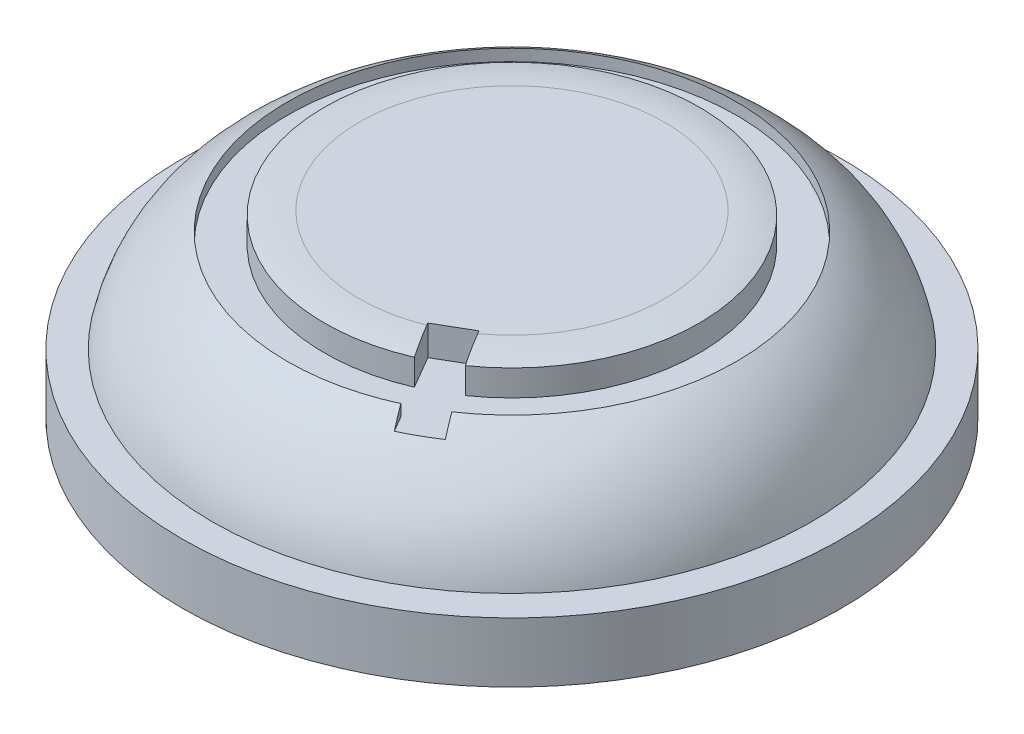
ISO-10303-21;
HEADER;
FILE_DESCRIPTION(('STEP AP214'),'2;1');
FILE_NAME('part.step','',(''),(''),'','','');
FILE_SCHEMA(('AUTOMOTIVE_DESIGN { 1 0 10303 214 1 1 1 1 }'));
ENDSEC;
DATA;
#1=APPLICATION_CONTEXT('core data for automotive mechanical design processes');
#2=APPLICATION_PROTOCOL_DEFINITION('international standard','automotive_design',2000,#1);
#3=PRODUCT_CONTEXT('',#1,'mechanical');
#4=PRODUCT('Part','Part','',(#3));
#5=PRODUCT_RELATED_PRODUCT_CATEGORY('part','',(#4));
#6=PRODUCT_DEFINITION_FORMATION('','',#4);
#7=PRODUCT_DEFINITION_CONTEXT('part definition',#1,'design');
#8=PRODUCT_DEFINITION('design','',#6,#7);
#9=PRODUCT_DEFINITION_SHAPE('','',#8);
#10=(LENGTH_UNIT() NAMED_UNIT(*) SI_UNIT(.MILLI.,.METRE.));
#11=(NAMED_UNIT(*) PLANE_ANGLE_UNIT() SI_UNIT($,.RADIAN.));
#12=(NAMED_UNIT(*) SI_UNIT($,.STERADIAN.) SOLID_ANGLE_UNIT());
#13=UNCERTAINTY_MEASURE_WITH_UNIT(LENGTH_MEASURE(1.E-05),#10,'distance_accuracy_value','');
#14=(GEOMETRIC_REPRESENTATION_CONTEXT(3) GLOBAL_UNCERTAINTY_ASSIGNED_CONTEXT((#13)) GLOBAL_UNIT_ASSIGNED_CONTEXT((#10,
#11,#12)) REPRESENTATION_CONTEXT('',''));
#15=CARTESIAN_POINT('',(0.,0.,0.));
#16=DIRECTION('',(0.,0.,1.));
#17=DIRECTION('',(1.,0.,0.));
#18=AXIS2_PLACEMENT_3D('',#15,#16,#17);
#19=CARTESIAN_POINT('',(0.,-5.,0.));
#20=DIRECTION('',(0.,1.,0.));
#21=DIRECTION('',(0.,0.,1.));
#22=AXIS2_PLACEMENT_3D('',#19,#20,#21);
#23=TOROIDAL_SURFACE('',#22,5.10102051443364,5.);
#24=CARTESIAN_POINT('',(0.,-0.613099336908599,0.));
#25=DIRECTION('',(0.,-1.,0.));
#26=DIRECTION('',(0.,0.,-1.));
#27=AXIS2_PLACEMENT_3D('',#24,#25,#26);
#28=CIRCLE('',#27,7.5);
#29=CARTESIAN_POINT('',(4.20402445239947,-0.613099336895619,6.21097242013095));
#30=VERTEX_POINT('',#29);
#31=CARTESIAN_POINT('',(3.1139140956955,-0.613099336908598,6.82301538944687));
#32=VERTEX_POINT('',#31);
#33=EDGE_CURVE('E11',#30,#32,#28,.F.);
#34=ORIENTED_EDGE('',*,*,#33,.F.);
#35=CARTESIAN_POINT('',(4.5077473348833,-1.0002,6.7313496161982));
#36=CARTESIAN_POINT('',(4.45943803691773,-0.928465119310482,6.64857989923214));
#37=CARTESIAN_POINT('',(4.40996341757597,-0.860328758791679,6.56381360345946));
#38=CARTESIAN_POINT('',(4.30868354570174,-0.731253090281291,6.39028787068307));
#39=CARTESIAN_POINT('',(4.25687829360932,-0.670313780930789,6.30152843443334));
#40=CARTESIAN_POINT('',(4.20390772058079,-0.612972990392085,6.21077242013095));
#41=B_SPLINE_CURVE_WITH_KNOTS('',3,(#35,#36,#37,#38,#39,#40),.UNSPECIFIED.,.F.,.F.,(4,2,4),(0.,
0.358441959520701,0.716883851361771),.UNSPECIFIED.);
#42=CARTESIAN_POINT('',(4.5076126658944,-1.,6.73111888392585));
#43=VERTEX_POINT('',#42);
#44=EDGE_CURVE('E48',#43,#30,#41,.T.);
#45=ORIENTED_EDGE('',*,*,#44,.F.);
#46=CARTESIAN_POINT('',(0.,-1.,0.));
#47=DIRECTION('',(0.,1.,0.));
#48=DIRECTION('',(0.,0.,1.));
#49=AXIS2_PLACEMENT_3D('',#46,#47,#48);
#50=CIRCLE('',#49,8.10102051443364);
#51=CARTESIAN_POINT('',(3.41828933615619,-1.,7.34451028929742));
#52=VERTEX_POINT('',#51);
#53=EDGE_CURVE('E240',#43,#52,#50,.F.);
#54=ORIENTED_EDGE('',*,*,#53,.T.);
#55=CARTESIAN_POINT('',(3.11379736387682,-0.612973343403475,6.82281538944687));
#56=CARTESIAN_POINT('',(3.16689960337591,-0.670294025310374,6.91379699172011));
#57=CARTESIAN_POINT('',(3.21883629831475,-0.731223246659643,7.00278163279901));
#58=CARTESIAN_POINT('',(3.32037862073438,-0.86029879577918,7.17675702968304));
#59=CARTESIAN_POINT('',(3.36998424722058,-0.928445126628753,7.26174778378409));
#60=CARTESIAN_POINT('',(3.41842432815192,-1.0002,7.34474157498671));
#61=B_SPLINE_CURVE_WITH_KNOTS('',3,(#55,#56,#57,#58,#59,#60),.UNSPECIFIED.,.F.,.F.,(4,2,4),(0.,
0.359099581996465,0.718199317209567),.UNSPECIFIED.);
#62=EDGE_CURVE('E233',#32,#52,#61,.T.);
#63=ORIENTED_EDGE('',*,*,#62,.F.);
#64=EDGE_LOOP('',(#34,#45,#54,#63));
#65=FACE_BOUND('',#64,.T.);
#66=CARTESIAN_POINT('',(0.,-4.,0.));
#67=DIRECTION('',(0.,1.,0.));
#68=DIRECTION('',(0.,0.,1.));
#69=AXIS2_PLACEMENT_3D('',#66,#67,#68);
#70=CIRCLE('',#69,10.);
#71=CARTESIAN_POINT('',(0.,-4.,10.));
#72=VERTEX_POINT('',#71);
#73=EDGE_CURVE('E185',#72,#72,#70,.T.);
#74=ORIENTED_EDGE('',*,*,#73,.T.);
#75=EDGE_LOOP('',(#74));
#76=FACE_BOUND('',#75,.T.);
#77=ADVANCED_FACE('F39',(#65,#76),#23,.T.);
#78=CARTESIAN_POINT('',(-10.,-4.,0.));
#79=DIRECTION('',(0.,1.,0.));
#80=DIRECTION('',(0.,0.,1.));
#81=AXIS2_PLACEMENT_3D('',#78,#79,#80);
#82=PLANE('',#81);
#83=CARTESIAN_POINT('',(0.,-4.,0.));
#84=DIRECTION('',(0.,1.,0.));
#85=DIRECTION('',(0.,0.,1.));
#86=AXIS2_PLACEMENT_3D('',#83,#84,#85);
#87=CIRCLE('',#86,11.);
#88=CARTESIAN_POINT('',(0.,-4.,11.));
#89=VERTEX_POINT('',#88);
#90=EDGE_CURVE('E181',#89,#89,#87,.T.);
#91=ORIENTED_EDGE('',*,*,#90,.T.);
#92=EDGE_LOOP('',(#91));
#93=FACE_BOUND('',#92,.T.);
#94=ORIENTED_EDGE('',*,*,#73,.F.);
#95=EDGE_LOOP('',(#94));
#96=FACE_BOUND('',#95,.T.);
#97=ADVANCED_FACE('F258',(#93,#96),#82,.T.);
#98=CARTESIAN_POINT('',(0.,8.27404181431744,0.));
#99=DIRECTION('',(0.,1.,0.));
#100=DIRECTION('',(0.,0.,1.));
#101=AXIS2_PLACEMENT_3D('',#98,#99,#100);
#102=CYLINDRICAL_SURFACE('',#101,11.);
#103=CARTESIAN_POINT('',(0.,-6.,0.));
#104=DIRECTION('',(0.,1.,0.));
#105=DIRECTION('',(0.,0.,1.));
#106=AXIS2_PLACEMENT_3D('',#103,#104,#105);
#107=CIRCLE('',#106,11.);
#108=CARTESIAN_POINT('',(0.,-6.,11.));
#109=VERTEX_POINT('',#108);
#110=EDGE_CURVE('E177',#109,#109,#107,.T.);
#111=ORIENTED_EDGE('',*,*,#110,.T.);
#112=EDGE_LOOP('',(#111));
#113=FACE_BOUND('',#112,.T.);
#114=ORIENTED_EDGE('',*,*,#90,.F.);
#115=EDGE_LOOP('',(#114));
#116=FACE_BOUND('',#115,.T.);
#117=ADVANCED_FACE('F263',(#113,#116),#102,.T.);
#118=CARTESIAN_POINT('',(-11.,-6.,0.));
#119=DIRECTION('',(0.,-1.,0.));
#120=DIRECTION('',(0.,0.,-1.));
#121=AXIS2_PLACEMENT_3D('',#118,#119,#120);
#122=PLANE('',#121);
#123=CARTESIAN_POINT('',(0.,-6.,0.));
#124=DIRECTION('',(0.,1.,0.));
#125=DIRECTION('',(0.,0.,1.));
#126=AXIS2_PLACEMENT_3D('',#123,#124,#125);
#127=CIRCLE('',#126,10.);
#128=CARTESIAN_POINT('',(0.,-6.,10.));
#129=VERTEX_POINT('',#128);
#130=EDGE_CURVE('E173',#129,#129,#127,.T.);
#131=ORIENTED_EDGE('',*,*,#130,.T.);
#132=EDGE_LOOP('',(#131));
#133=FACE_BOUND('',#132,.T.);
#134=ORIENTED_EDGE('',*,*,#110,.F.);
#135=EDGE_LOOP('',(#134));
#136=FACE_BOUND('',#135,.T.);
#137=ADVANCED_FACE('F357',(#133,#136),#122,.T.);
#138=CARTESIAN_POINT('',(0.,8.27404181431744,0.));
#139=DIRECTION('',(0.,1.,0.));
#140=DIRECTION('',(0.,0.,1.));
#141=AXIS2_PLACEMENT_3D('',#138,#139,#140);
#142=CYLINDRICAL_SURFACE('',#141,10.);
#143=CARTESIAN_POINT('',(0.,-4.5,0.));
#144=DIRECTION('',(0.,1.,0.));
#145=DIRECTION('',(0.,0.,1.));
#146=AXIS2_PLACEMENT_3D('',#143,#144,#145);
#147=CIRCLE('',#146,10.);
#148=CARTESIAN_POINT('',(0.,-4.5,10.));
#149=VERTEX_POINT('',#148);
#150=EDGE_CURVE('E166',#149,#149,#147,.T.);
#151=ORIENTED_EDGE('',*,*,#150,.T.);
#152=EDGE_LOOP('',(#151));
#153=FACE_BOUND('',#152,.T.);
#154=ORIENTED_EDGE('',*,*,#130,.F.);
#155=EDGE_LOOP('',(#154));
#156=FACE_BOUND('',#155,.T.);
#157=ADVANCED_FACE('F347',(#153,#156),#142,.F.);
#158=CARTESIAN_POINT('',(-10.,-4.5,0.));
#159=DIRECTION('',(0.,-1.,0.));
#160=DIRECTION('',(0.,0.,-1.));
#161=AXIS2_PLACEMENT_3D('',#158,#159,#160);
#162=PLANE('',#161);
#163=ORIENTED_EDGE('',*,*,#150,.F.);
#164=EDGE_LOOP('',(#163));
#165=FACE_BOUND('',#164,.T.);
#166=ADVANCED_FACE('F333',(#165),#162,.T.);
#167=CARTESIAN_POINT('',(0.,-1.,0.));
#168=DIRECTION('',(0.,1.,0.));
#169=DIRECTION('',(0.,0.,1.));
#170=AXIS2_PLACEMENT_3D('',#167,#168,#169);
#171=CYLINDRICAL_SURFACE('',#170,7.5);
#172=ORIENTED_EDGE('',*,*,#33,.T.);
#173=DIRECTION('',(0.,1.,0.));
#174=VECTOR('',#173,1.);
#175=CARTESIAN_POINT('',(3.1139140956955,-1.,6.82301538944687));
#176=LINE('',#175,#174);
#177=CARTESIAN_POINT('',(3.1139140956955,-1.,6.82301538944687));
#178=VERTEX_POINT('',#177);
#179=EDGE_CURVE('E161',#178,#32,#176,.T.);
#180=ORIENTED_EDGE('',*,*,#179,.F.);
#181=CARTESIAN_POINT('',(0.,-1.,0.));
#182=DIRECTION('',(0.,1.,0.));
#183=DIRECTION('',(0.,0.,1.));
#184=AXIS2_PLACEMENT_3D('',#181,#182,#183);
#185=CIRCLE('',#184,7.5);
#186=CARTESIAN_POINT('',(4.20402445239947,-1.,6.21097242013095));
#187=VERTEX_POINT('',#186);
#188=EDGE_CURVE('E147',#187,#178,#185,.T.);
#189=ORIENTED_EDGE('',*,*,#188,.F.);
#190=DIRECTION('',(0.,1.,0.));
#191=VECTOR('',#190,1.);
#192=CARTESIAN_POINT('',(4.20402445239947,-1.,6.21097242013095));
#193=LINE('',#192,#191);
#194=EDGE_CURVE('E162',#187,#30,#193,.T.);
#195=ORIENTED_EDGE('',*,*,#194,.T.);
#196=EDGE_LOOP('',(#172,#180,#189,#195));
#197=FACE_BOUND('',#196,.T.);
#198=ADVANCED_FACE('F223',(#197),#171,.F.);
#199=CARTESIAN_POINT('',(4.78695355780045,-1.,7.20972171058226));
#200=DIRECTION('',(0.863656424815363,0.,-0.504080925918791));
#201=DIRECTION('',(-0.504080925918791,0.,-0.863656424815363));
#202=AXIS2_PLACEMENT_3D('',#199,#200,#201);
#203=PLANE('',#202);
#204=ORIENTED_EDGE('',*,*,#44,.T.);
#205=ORIENTED_EDGE('',*,*,#194,.F.);
#206=DIRECTION('',(-0.504080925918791,0.,-0.863656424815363));
#207=VECTOR('',#206,1.);
#208=CARTESIAN_POINT('',(4.78695355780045,-1.,7.20972171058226));
#209=LINE('',#208,#207);
#210=EDGE_CURVE('E158',#43,#187,#209,.T.);
#211=ORIENTED_EDGE('',*,*,#210,.F.);
#212=EDGE_LOOP('',(#204,#205,#211));
#213=FACE_BOUND('',#212,.T.);
#214=ADVANCED_FACE('F219',(#213),#203,.F.);
#215=CARTESIAN_POINT('',(3.1139140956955,-1.,6.82301538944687));
#216=DIRECTION('',(-0.863656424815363,0.,0.50408092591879));
#217=DIRECTION('',(0.50408092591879,0.,0.863656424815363));
#218=AXIS2_PLACEMENT_3D('',#215,#216,#217);
#219=PLANE('',#218);
#220=ORIENTED_EDGE('',*,*,#62,.T.);
#221=DIRECTION('',(0.50408092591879,0.,0.863656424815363));
#222=VECTOR('',#221,1.);
#223=CARTESIAN_POINT('',(3.1139140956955,-1.,6.82301538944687));
#224=LINE('',#223,#222);
#225=EDGE_CURVE('E55',#178,#52,#224,.T.);
#226=ORIENTED_EDGE('',*,*,#225,.F.);
#227=ORIENTED_EDGE('',*,*,#179,.T.);
#228=EDGE_LOOP('',(#220,#226,#227));
#229=FACE_BOUND('',#228,.T.);
#230=ADVANCED_FACE('F218',(#229),#219,.F.);
#231=CARTESIAN_POINT('',(0.,-1.,0.));
#232=DIRECTION('',(0.,1.,0.));
#233=DIRECTION('',(0.,0.,1.));
#234=AXIS2_PLACEMENT_3D('',#231,#232,#233);
#235=PLANE('',#234);
#236=DIRECTION('',(-0.504080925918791,0.,-0.863656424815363));
#237=VECTOR('',#236,1.);
#238=CARTESIAN_POINT('',(1.84989641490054,-1.,4.65733735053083));
#239=LINE('',#238,#237);
#240=CARTESIAN_POINT('',(2.47999757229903,-1.,5.73690788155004));
#241=VERTEX_POINT('',#240);
#242=CARTESIAN_POINT('',(1.84989641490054,-1.,4.65733735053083));
#243=VERTEX_POINT('',#242);
#244=EDGE_CURVE('E115',#241,#243,#239,.T.);
#245=ORIENTED_EDGE('',*,*,#244,.F.);
#246=CARTESIAN_POINT('',(0.,-1.,0.));
#247=DIRECTION('',(0.,1.,0.));
#248=DIRECTION('',(0.,0.,1.));
#249=AXIS2_PLACEMENT_3D('',#246,#247,#248);
#250=CIRCLE('',#249,6.25);
#251=CARTESIAN_POINT('',(3.57223619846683,-1.,5.12851133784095));
#252=VERTEX_POINT('',#251);
#253=EDGE_CURVE('E124',#252,#241,#250,.T.);
#254=ORIENTED_EDGE('',*,*,#253,.F.);
#255=DIRECTION('',(0.504080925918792,0.,0.863656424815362));
#256=VECTOR('',#255,1.);
#257=CARTESIAN_POINT('',(3.57223619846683,-1.,5.12851133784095));
#258=LINE('',#257,#256);
#259=CARTESIAN_POINT('',(2.92946694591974,-1.,4.02723619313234));
#260=VERTEX_POINT('',#259);
#261=EDGE_CURVE('E107',#260,#252,#258,.T.);
#262=ORIENTED_EDGE('',*,*,#261,.F.);
#263=DIRECTION('',(0.863656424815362,0.,-0.504080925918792));
#264=VECTOR('',#263,1.);
#265=CARTESIAN_POINT('',(2.92946694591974,-1.,4.02723619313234));
#266=LINE('',#265,#264);
#267=EDGE_CURVE('E121',#243,#260,#266,.T.);
#268=ORIENTED_EDGE('',*,*,#267,.F.);
#269=EDGE_LOOP('',(#245,#254,#262,#268));
#270=FACE_BOUND('',#269,.T.);
#271=ORIENTED_EDGE('',*,*,#210,.T.);
#272=ORIENTED_EDGE('',*,*,#188,.T.);
#273=ORIENTED_EDGE('',*,*,#225,.T.);
#274=ORIENTED_EDGE('',*,*,#53,.F.);
#275=EDGE_LOOP('',(#271,#272,#273,#274));
#276=FACE_BOUND('',#275,.T.);
#277=ADVANCED_FACE('F120',(#270,#276),#235,.T.);
#278=CARTESIAN_POINT('',(2.92946694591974,-1.,4.02723619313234));
#279=DIRECTION('',(0.504080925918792,0.,0.863656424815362));
#280=DIRECTION('',(0.863656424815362,0.,-0.504080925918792));
#281=AXIS2_PLACEMENT_3D('',#278,#279,#280);
#282=PLANE('',#281);
#283=DIRECTION('',(0.863656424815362,0.,-0.504080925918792));
#284=VECTOR('',#283,1.);
#285=CARTESIAN_POINT('',(2.92946694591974,0.,4.02723619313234));
#286=LINE('',#285,#284);
#287=CARTESIAN_POINT('',(1.84989641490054,0.,4.65733735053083));
#288=VERTEX_POINT('',#287);
#289=CARTESIAN_POINT('',(2.92946694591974,0.,4.02723619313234));
#290=VERTEX_POINT('',#289);
#291=EDGE_CURVE('E140',#288,#290,#286,.T.);
#292=ORIENTED_EDGE('',*,*,#291,.F.);
#293=DIRECTION('',(0.,1.,0.));
#294=VECTOR('',#293,1.);
#295=CARTESIAN_POINT('',(1.84989641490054,-1.,4.65733735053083));
#296=LINE('',#295,#294);
#297=EDGE_CURVE('E128',#243,#288,#296,.T.);
#298=ORIENTED_EDGE('',*,*,#297,.F.);
#299=ORIENTED_EDGE('',*,*,#267,.T.);
#300=DIRECTION('',(0.,1.,0.));
#301=VECTOR('',#300,1.);
#302=CARTESIAN_POINT('',(2.92946694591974,-1.,4.02723619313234));
#303=LINE('',#302,#301);
#304=EDGE_CURVE('E104',#260,#290,#303,.T.);
#305=ORIENTED_EDGE('',*,*,#304,.T.);
#306=EDGE_LOOP('',(#292,#298,#299,#305));
#307=FACE_BOUND('',#306,.T.);
#308=ADVANCED_FACE('F127',(#307),#282,.T.);
#309=CARTESIAN_POINT('',(1.84989641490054,-1.,4.65733735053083));
#310=DIRECTION('',(0.863656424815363,0.,-0.504080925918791));
#311=DIRECTION('',(-0.504080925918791,0.,-0.863656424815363));
#312=AXIS2_PLACEMENT_3D('',#309,#310,#311);
#313=PLANE('',#312);
#314=DIRECTION('',(0.,1.,0.));
#315=VECTOR('',#314,1.);
#316=CARTESIAN_POINT('',(2.47999757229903,-1.,5.73690788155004));
#317=LINE('',#316,#315);
#318=CARTESIAN_POINT('',(2.47999757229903,-0.133805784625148,5.73690788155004));
#319=VERTEX_POINT('',#318);
#320=EDGE_CURVE('E148',#241,#319,#317,.T.);
#321=ORIENTED_EDGE('',*,*,#320,.F.);
#322=ORIENTED_EDGE('',*,*,#244,.T.);
#323=ORIENTED_EDGE('',*,*,#297,.T.);
#324=DIRECTION('',(-0.504080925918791,0.,-0.863656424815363));
#325=VECTOR('',#324,1.);
#326=CARTESIAN_POINT('',(1.84989641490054,0.,4.65733735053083));
#327=LINE('',#326,#325);
#328=CARTESIAN_POINT('',(1.89563995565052,0.,4.73571108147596));
#329=VERTEX_POINT('',#328);
#330=EDGE_CURVE('E130',#329,#288,#327,.T.);
#331=ORIENTED_EDGE('',*,*,#330,.F.);
#332=CARTESIAN_POINT('',(2.48011430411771,-0.133860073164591,5.73710788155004));
#333=CARTESIAN_POINT('',(2.42844861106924,-0.109821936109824,5.64858755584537));
#334=CARTESIAN_POINT('',(2.37641068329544,-0.0890018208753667,5.55942946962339));
#335=CARTESIAN_POINT('',(2.27198276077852,-0.0538960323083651,5.38051009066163));
#336=CARTESIAN_POINT('',(2.21959487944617,-0.0395856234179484,5.29075241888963));
#337=CARTESIAN_POINT('',(2.0617435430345,-0.00629513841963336,5.02030116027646));
#338=CARTESIAN_POINT('',(1.95574015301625,0.0029758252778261,4.83868248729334));
#339=CARTESIAN_POINT('',(1.84977968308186,-0.000809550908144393,4.65713735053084));
#340=B_SPLINE_CURVE_WITH_KNOTS('',3,(#332,#333,#334,#335,#336,#337,#338,#339),.UNSPECIFIED.,.F.,
.F.,(4,2,2,4),(0.,0.31574589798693,0.630281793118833,1.26024992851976),.UNSPECIFIED.);
#341=EDGE_CURVE('E243',#319,#329,#340,.T.);
#342=ORIENTED_EDGE('',*,*,#341,.F.);
#343=EDGE_LOOP('',(#321,#322,#323,#331,#342));
#344=FACE_BOUND('',#343,.T.);
#345=ADVANCED_FACE('F215',(#344),#313,.T.);
#346=CARTESIAN_POINT('',(0.,-1.,0.));
#347=DIRECTION('',(0.,1.,0.));
#348=DIRECTION('',(0.,0.,1.));
#349=AXIS2_PLACEMENT_3D('',#346,#347,#348);
#350=CYLINDRICAL_SURFACE('',#349,6.25);
#351=DIRECTION('',(0.,1.,0.));
#352=VECTOR('',#351,1.);
#353=CARTESIAN_POINT('',(3.57223619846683,-1.,5.12851133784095));
#354=LINE('',#353,#352);
#355=CARTESIAN_POINT('',(3.57223619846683,-0.133805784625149,5.12851133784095));
#356=VERTEX_POINT('',#355);
#357=EDGE_CURVE('E63',#252,#356,#354,.T.);
#358=ORIENTED_EDGE('',*,*,#357,.F.);
#359=ORIENTED_EDGE('',*,*,#253,.T.);
#360=ORIENTED_EDGE('',*,*,#320,.T.);
#361=CARTESIAN_POINT('',(0.,-0.133805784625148,0.));
#362=DIRECTION('',(0.,-1.,0.));
#363=DIRECTION('',(0.,0.,-1.));
#364=AXIS2_PLACEMENT_3D('',#361,#362,#363);
#365=CIRCLE('',#364,6.25);
#366=EDGE_CURVE('E202',#356,#319,#365,.F.);
#367=ORIENTED_EDGE('',*,*,#366,.F.);
#368=EDGE_LOOP('',(#358,#359,#360,#367));
#369=FACE_BOUND('',#368,.T.);
#370=ADVANCED_FACE('F211',(#369),#350,.T.);
#371=CARTESIAN_POINT('',(3.57223619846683,-1.,5.12851133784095));
#372=DIRECTION('',(-0.863656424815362,0.,0.504080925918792));
#373=DIRECTION('',(0.504080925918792,0.,0.863656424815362));
#374=AXIS2_PLACEMENT_3D('',#371,#372,#373);
#375=PLANE('',#374);
#376=DIRECTION('',(0.504080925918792,0.,0.863656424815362));
#377=VECTOR('',#376,1.);
#378=CARTESIAN_POINT('',(3.57223619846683,0.,5.12851133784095));
#379=LINE('',#378,#377);
#380=CARTESIAN_POINT('',(2.99077309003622,0.,4.1322737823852));
#381=VERTEX_POINT('',#380);
#382=EDGE_CURVE('E109',#290,#381,#379,.T.);
#383=ORIENTED_EDGE('',*,*,#382,.F.);
#384=ORIENTED_EDGE('',*,*,#304,.F.);
#385=ORIENTED_EDGE('',*,*,#261,.T.);
#386=ORIENTED_EDGE('',*,*,#357,.T.);
#387=CARTESIAN_POINT('',(2.92935021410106,-0.00147037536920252,4.02703619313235));
#388=CARTESIAN_POINT('',(3.03741935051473,0.00374886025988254,4.21219416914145));
#389=CARTESIAN_POINT('',(3.14557033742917,-0.00478406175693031,4.39749238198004));
#390=CARTESIAN_POINT('',(3.30660862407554,-0.0379330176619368,4.67340393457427));
#391=CARTESIAN_POINT('',(3.36004986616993,-0.0523555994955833,4.7649663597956));
#392=CARTESIAN_POINT('',(3.46657709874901,-0.087997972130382,4.94748254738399));
#393=CARTESIAN_POINT('',(3.51966075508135,-0.109245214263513,5.03843231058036));
#394=CARTESIAN_POINT('',(3.57235293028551,-0.133860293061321,5.12871133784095));
#395=B_SPLINE_CURVE_WITH_KNOTS('',3,(#387,#388,#389,#390,#391,#392,#393,#394),.UNSPECIFIED.,.F.,
.F.,(4,2,2,4),(0.,0.642529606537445,0.963307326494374,1.28539184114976),.UNSPECIFIED.);
#396=EDGE_CURVE('E193',#381,#356,#395,.T.);
#397=ORIENTED_EDGE('',*,*,#396,.F.);
#398=EDGE_LOOP('',(#383,#384,#385,#386,#397));
#399=FACE_BOUND('',#398,.T.);
#400=ADVANCED_FACE('F106',(#399),#375,.T.);
#401=ORIENTED_EDGE('',*,*,#366,.T.);
#402=ORIENTED_EDGE('',*,*,#341,.T.);
#403=CARTESIAN_POINT('',(0.,0.,0.));
#404=DIRECTION('',(0.,1.,0.));
#405=DIRECTION('',(0.,0.,1.));
#406=AXIS2_PLACEMENT_3D('',#403,#404,#405);
#407=CIRCLE('',#406,5.10102051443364);
#408=EDGE_CURVE('E189',#381,#329,#407,.T.);
#409=ORIENTED_EDGE('',*,*,#408,.F.);
#410=ORIENTED_EDGE('',*,*,#396,.T.);
#411=EDGE_LOOP('',(#401,#402,#409,#410));
#412=FACE_BOUND('',#411,.T.);
#413=ADVANCED_FACE('F210',(#412),#23,.T.);
#414=CARTESIAN_POINT('',(0.,0.,0.));
#415=DIRECTION('',(0.,1.,0.));
#416=DIRECTION('',(0.,0.,1.));
#417=AXIS2_PLACEMENT_3D('',#414,#415,#416);
#418=PLANE('',#417);
#419=ORIENTED_EDGE('',*,*,#408,.T.);
#420=ORIENTED_EDGE('',*,*,#330,.T.);
#421=ORIENTED_EDGE('',*,*,#291,.T.);
#422=ORIENTED_EDGE('',*,*,#382,.T.);
#423=EDGE_LOOP('',(#419,#420,#421,#422));
#424=FACE_BOUND('',#423,.T.);
#425=ADVANCED_FACE('F41',(#424),#418,.T.);
#426=CLOSED_SHELL('',(#77,#97,#117,#137,#157,#166,#198,#214,#230,#277,#308,#345,#370,#400,#413,#425));
#427=MANIFOLD_SOLID_BREP('B2',#426);
#428=ADVANCED_BREP_SHAPE_REPRESENTATION('',(#18,#427),#14);
#429=SHAPE_DEFINITION_REPRESENTATION(#9,#428);
ENDSEC;
END-ISO-10303-21;
